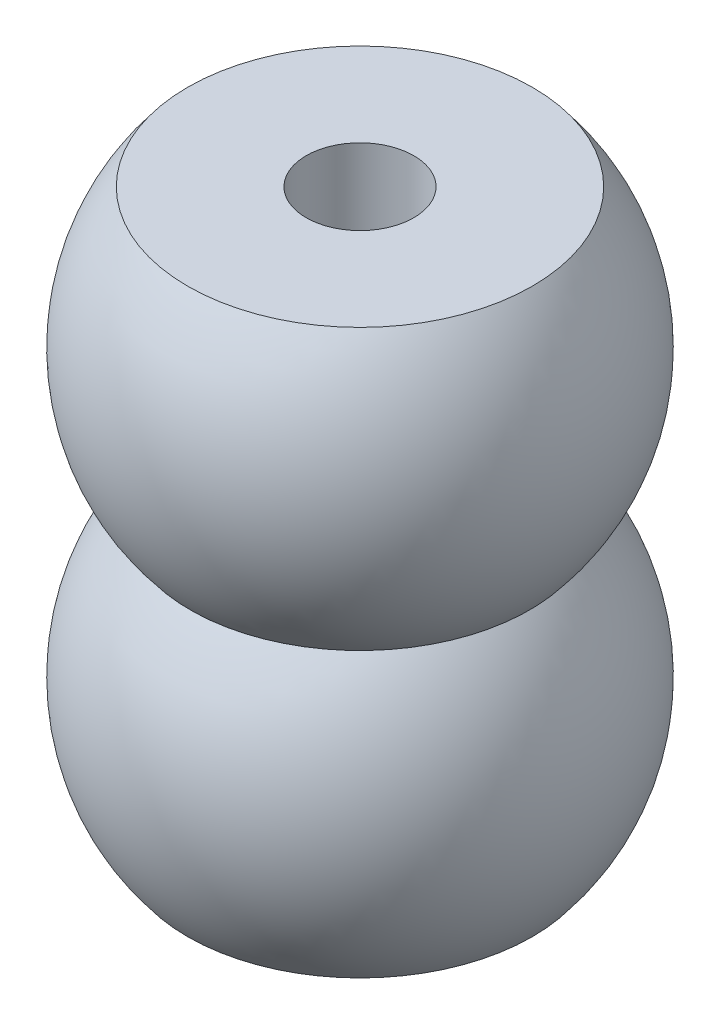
ISO-10303-21;
HEADER;
FILE_DESCRIPTION(('STEP AP214'),'2;1');
FILE_NAME('part.step','',(''),(''),'','','');
FILE_SCHEMA(('AUTOMOTIVE_DESIGN { 1 0 10303 214 1 1 1 1 }'));
ENDSEC;
DATA;
#1=APPLICATION_CONTEXT('core data for automotive mechanical design processes');
#2=APPLICATION_PROTOCOL_DEFINITION('international standard','automotive_design',2000,#1);
#3=PRODUCT_CONTEXT('',#1,'mechanical');
#4=PRODUCT('Part','Part','',(#3));
#5=PRODUCT_RELATED_PRODUCT_CATEGORY('part','',(#4));
#6=PRODUCT_DEFINITION_FORMATION('','',#4);
#7=PRODUCT_DEFINITION_CONTEXT('part definition',#1,'design');
#8=PRODUCT_DEFINITION('design','',#6,#7);
#9=PRODUCT_DEFINITION_SHAPE('','',#8);
#10=(LENGTH_UNIT() NAMED_UNIT(*) SI_UNIT(.MILLI.,.METRE.));
#11=(NAMED_UNIT(*) PLANE_ANGLE_UNIT() SI_UNIT($,.RADIAN.));
#12=(NAMED_UNIT(*) SI_UNIT($,.STERADIAN.) SOLID_ANGLE_UNIT());
#13=UNCERTAINTY_MEASURE_WITH_UNIT(LENGTH_MEASURE(1.E-05),#10,'distance_accuracy_value','');
#14=(GEOMETRIC_REPRESENTATION_CONTEXT(3) GLOBAL_UNCERTAINTY_ASSIGNED_CONTEXT((#13)) GLOBAL_UNIT_ASSIGNED_CONTEXT((#10,
#11,#12)) REPRESENTATION_CONTEXT('',''));
#15=CARTESIAN_POINT('',(0.,0.,0.));
#16=DIRECTION('',(0.,0.,1.));
#17=DIRECTION('',(1.,0.,0.));
#18=AXIS2_PLACEMENT_3D('',#15,#16,#17);
#19=CARTESIAN_POINT('',(0.,67.,0.));
#20=DIRECTION('',(0.,-1.,0.));
#21=DIRECTION('',(-1.,0.,0.));
#22=AXIS2_PLACEMENT_3D('',#19,#20,#21);
#23=SPHERICAL_SURFACE('',#22,35.);
#24=CARTESIAN_POINT('',(0.,44.5,0.));
#25=DIRECTION('',(0.,-1.,0.));
#26=DIRECTION('',(0.,0.,-1.));
#27=AXIS2_PLACEMENT_3D('',#24,#25,#26);
#28=CIRCLE('',#27,26.809513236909);
#29=CARTESIAN_POINT('',(-26.809513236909,44.5,0.));
#30=VERTEX_POINT('',#29);
#31=EDGE_CURVE('E10',#30,#30,#28,.T.);
#32=CARTESIAN_POINT('',(0.,89.,0.));
#33=DIRECTION('',(0.,-1.,0.));
#34=DIRECTION('',(0.,0.,-1.));
#35=AXIS2_PLACEMENT_3D('',#32,#33,#34);
#36=CIRCLE('',#35,27.2213151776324);
#37=CARTESIAN_POINT('',(-27.2213151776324,89.,0.));
#38=VERTEX_POINT('',#37);
#39=EDGE_CURVE('E48',#38,#38,#36,.T.);
#40=CARTESIAN_POINT('',(-26.809513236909,44.5,0.));
#41=CARTESIAN_POINT('',(-27.1324730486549,44.8848063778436,0.));
#42=CARTESIAN_POINT('',(-27.4471366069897,45.2765747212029,0.));
#43=CARTESIAN_POINT('',(-28.0593129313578,46.0732897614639,0.));
#44=CARTESIAN_POINT('',(-28.356825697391,46.4782364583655,0.));
#45=CARTESIAN_POINT('',(-28.9341421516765,47.3005626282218,0.));
#46=CARTESIAN_POINT('',(-29.2139458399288,47.7179421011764,0.));
#47=CARTESIAN_POINT('',(-29.755327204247,48.5643586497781,0.));
#48=CARTESIAN_POINT('',(-30.0169048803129,48.9933957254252,0.));
#49=CARTESIAN_POINT('',(-30.5213487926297,49.8623324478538,0.));
#50=CARTESIAN_POINT('',(-30.7642150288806,50.3022320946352,0.));
#51=CARTESIAN_POINT('',(-31.2307859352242,51.1920783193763,0.));
#52=CARTESIAN_POINT('',(-31.4544906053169,51.6420248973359,0.));
#53=CARTESIAN_POINT('',(-31.8823236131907,52.5511308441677,0.));
#54=CARTESIAN_POINT('',(-32.0864519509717,53.0102902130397,0.));
#55=CARTESIAN_POINT('',(-32.4747538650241,53.9369704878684,0.));
#56=CARTESIAN_POINT('',(-32.6589274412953,54.404491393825,0.));
#57=CARTESIAN_POINT('',(-33.0069783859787,55.3470279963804,0.));
#58=CARTESIAN_POINT('',(-33.1708557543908,55.8220436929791,0.));
#59=CARTESIAN_POINT('',(-33.4780104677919,56.7786892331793,0.));
#60=CARTESIAN_POINT('',(-33.621287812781,57.2603190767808,0.));
#61=CARTESIAN_POINT('',(-33.8869768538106,58.2293000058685,0.));
#62=CARTESIAN_POINT('',(-34.0093885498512,58.7166510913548,0.));
#63=CARTESIAN_POINT('',(-34.2331193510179,59.6961709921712,0.));
#64=CARTESIAN_POINT('',(-34.334438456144,60.1883398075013,0.));
#65=CARTESIAN_POINT('',(-34.5157962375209,61.1765827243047,0.));
#66=CARTESIAN_POINT('',(-34.5958349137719,61.672656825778,0.));
#67=CARTESIAN_POINT('',(-34.7344834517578,62.6677906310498,0.));
#68=CARTESIAN_POINT('',(-34.7930933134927,63.1668503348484,0.));
#69=CARTESIAN_POINT('',(-34.8887755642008,64.1670301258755,0.));
#70=CARTESIAN_POINT('',(-34.9258479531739,64.6681502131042,0.));
#71=CARTESIAN_POINT('',(-34.978386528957,65.6715217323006,0.));
#72=CARTESIAN_POINT('',(-34.9938527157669,66.1737731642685,0.));
#73=CARTESIAN_POINT('',(-35.0031502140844,67.1784762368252,0.));
#74=CARTESIAN_POINT('',(-34.996981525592,67.6809278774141,0.));
#75=CARTESIAN_POINT('',(-34.9630207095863,68.6850998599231,0.));
#76=CARTESIAN_POINT('',(-34.9352285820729,69.1868202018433,0.));
#77=CARTESIAN_POINT('',(-34.8580724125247,70.1885994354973,0.));
#78=CARTESIAN_POINT('',(-34.8087083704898,70.6886583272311,0.));
#79=CARTESIAN_POINT('',(-34.6884998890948,71.6861875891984,0.));
#80=CARTESIAN_POINT('',(-34.6176554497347,72.183657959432,0.));
#81=CARTESIAN_POINT('',(-34.4546175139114,73.1750879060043,0.));
#82=CARTESIAN_POINT('',(-34.362424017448,73.6690474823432,0.));
#83=CARTESIAN_POINT('',(-34.1568588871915,74.65254007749,0.));
#84=CARTESIAN_POINT('',(-34.0434872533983,75.142073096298,0.));
#85=CARTESIAN_POINT('',(-33.7957760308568,76.1158050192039,0.));
#86=CARTESIAN_POINT('',(-33.6614364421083,76.6000039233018,0.));
#87=CARTESIAN_POINT('',(-33.372038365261,77.5621699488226,0.));
#88=CARTESIAN_POINT('',(-33.2169798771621,78.0401370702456,0.));
#89=CARTESIAN_POINT('',(-32.8864314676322,78.9889534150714,0.));
#90=CARTESIAN_POINT('',(-32.7109415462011,79.4598026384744,0.));
#91=CARTESIAN_POINT('',(-32.3398556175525,80.393510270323,0.));
#92=CARTESIAN_POINT('',(-32.144259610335,80.8563686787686,0.));
#93=CARTESIAN_POINT('',(-31.7333241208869,81.7732365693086,0.));
#94=CARTESIAN_POINT('',(-31.5179846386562,82.2272460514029,0.));
#95=CARTESIAN_POINT('',(-31.0679614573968,83.125574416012,0.));
#96=CARTESIAN_POINT('',(-30.8332777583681,83.5698932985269,0.));
#97=CARTESIAN_POINT('',(-30.3450010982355,84.4480166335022,0.));
#98=CARTESIAN_POINT('',(-30.0914081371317,84.8818210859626,0.));
#99=CARTESIAN_POINT('',(-29.5657835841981,85.7381116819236,0.));
#100=CARTESIAN_POINT('',(-29.2937519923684,86.1605978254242,0.));
#101=CARTESIAN_POINT('',(-28.7317526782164,86.9934671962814,0.));
#102=CARTESIAN_POINT('',(-28.4417849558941,87.4038504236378,0.));
#103=CARTESIAN_POINT('',(-27.8444577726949,88.2117581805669,0.));
#104=CARTESIAN_POINT('',(-27.5370983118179,88.6092827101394,0.));
#105=CARTESIAN_POINT('',(-27.2213151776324,89.,0.));
#106=B_SPLINE_CURVE_WITH_KNOTS('',3,(#40,#41,#42,#43,#44,#45,#46,#47,#48,#49,#50,#51,#52,#53,
#54,#55,#56,#57,#58,#59,#60,#61,#62,#63,#64,#65,#66,#67,#68,#69,#70,#71,#72,#73,#74,#75,#76,#77,
#78,#79,#80,#81,#82,#83,#84,#85,#86,#87,#88,#89,#90,#91,#92,#93,#94,#95,#96,#97,#98,#99,#100,
#101,#102,#103,#104,#105),.UNSPECIFIED.,.F.,.F.,(4,2,2,2,2,2,2,2,2,2,2,2,2,2,2,2,2,2,2,2,2,2,2,
2,2,2,2,2,2,2,2,2,4),(0.,1.50700272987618,3.01400545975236,4.52100818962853,6.02801091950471,
7.5350136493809,9.04201637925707,10.5490191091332,12.0560218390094,13.5630245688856,
15.0700272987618,16.577030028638,18.0840327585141,19.5910354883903,21.0980382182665,
22.6050409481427,24.1120436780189,25.619046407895,27.1260491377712,28.6330518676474,
30.1400545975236,31.6470573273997,33.1540600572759,34.6610627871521,36.1680655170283,
37.6750682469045,39.1820709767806,40.6890737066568,42.196076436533,43.7030791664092,
45.2100818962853,46.7170846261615,48.2240873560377),.UNSPECIFIED.);
#107=EDGE_CURVE('BSEAM29',#30,#38,#106,.T.);
#108=ORIENTED_EDGE('',*,*,#31,.F.);
#109=ORIENTED_EDGE('',*,*,#39,.T.);
#110=ORIENTED_EDGE('',*,*,#107,.T.);
#111=ORIENTED_EDGE('',*,*,#107,.F.);
#112=EDGE_LOOP('',(#108,#110,#109,#111));
#113=FACE_BOUND('',#112,.T.);
#114=ADVANCED_FACE('F29',(#113),#23,.T.);
#115=CARTESIAN_POINT('',(0.,22.,0.));
#116=DIRECTION('',(0.,-1.,0.));
#117=DIRECTION('',(-1.,0.,0.));
#118=AXIS2_PLACEMENT_3D('',#115,#116,#117);
#119=SPHERICAL_SURFACE('',#118,35.);
#120=CARTESIAN_POINT('',(0.,0.,0.));
#121=DIRECTION('',(0.,-1.,0.));
#122=DIRECTION('',(0.,0.,-1.));
#123=AXIS2_PLACEMENT_3D('',#120,#121,#122);
#124=CIRCLE('',#123,27.2213151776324);
#125=CARTESIAN_POINT('',(-27.2213151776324,0.,0.));
#126=VERTEX_POINT('',#125);
#127=EDGE_CURVE('E35',#126,#126,#124,.T.);
#128=CARTESIAN_POINT('',(-27.2213151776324,0.,0.));
#129=CARTESIAN_POINT('',(-27.5370983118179,0.390717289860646,0.));
#130=CARTESIAN_POINT('',(-27.8444577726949,0.788241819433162,0.));
#131=CARTESIAN_POINT('',(-28.4417849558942,1.59614957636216,0.));
#132=CARTESIAN_POINT('',(-28.7317526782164,2.00653280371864,0.));
#133=CARTESIAN_POINT('',(-29.2937519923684,2.83940217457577,0.));
#134=CARTESIAN_POINT('',(-29.5657835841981,3.26188831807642,0.));
#135=CARTESIAN_POINT('',(-30.0914081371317,4.11817891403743,0.));
#136=CARTESIAN_POINT('',(-30.3450010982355,4.5519833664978,0.));
#137=CARTESIAN_POINT('',(-30.8332777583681,5.43010670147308,0.));
#138=CARTESIAN_POINT('',(-31.0679614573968,5.87442558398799,0.));
#139=CARTESIAN_POINT('',(-31.5179846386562,6.77275394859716,0.));
#140=CARTESIAN_POINT('',(-31.7333241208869,7.22676343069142,0.));
#141=CARTESIAN_POINT('',(-32.1442596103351,8.14363132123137,0.));
#142=CARTESIAN_POINT('',(-32.3398556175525,8.60648972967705,0.));
#143=CARTESIAN_POINT('',(-32.7109415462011,9.54019736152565,0.));
#144=CARTESIAN_POINT('',(-32.8864314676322,10.0110465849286,0.));
#145=CARTESIAN_POINT('',(-33.2169798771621,10.9598629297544,0.));
#146=CARTESIAN_POINT('',(-33.372038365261,11.4378300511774,0.));
#147=CARTESIAN_POINT('',(-33.6614364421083,12.3999960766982,0.));
#148=CARTESIAN_POINT('',(-33.7957760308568,12.8841949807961,0.));
#149=CARTESIAN_POINT('',(-34.0434872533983,13.857926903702,0.));
#150=CARTESIAN_POINT('',(-34.1568588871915,14.34745992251,0.));
#151=CARTESIAN_POINT('',(-34.362424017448,15.3309525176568,0.));
#152=CARTESIAN_POINT('',(-34.4546175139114,15.8249120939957,0.));
#153=CARTESIAN_POINT('',(-34.6176554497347,16.8163420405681,0.));
#154=CARTESIAN_POINT('',(-34.6884998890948,17.3138124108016,0.));
#155=CARTESIAN_POINT('',(-34.8087083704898,18.3113416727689,0.));
#156=CARTESIAN_POINT('',(-34.8580724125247,18.8114005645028,0.));
#157=CARTESIAN_POINT('',(-34.9352285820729,19.8131797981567,0.));
#158=CARTESIAN_POINT('',(-34.9630207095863,20.3149001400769,0.));
#159=CARTESIAN_POINT('',(-34.996981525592,21.319072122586,0.));
#160=CARTESIAN_POINT('',(-35.0031502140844,21.8215237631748,0.));
#161=CARTESIAN_POINT('',(-34.9938527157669,22.8262268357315,0.));
#162=CARTESIAN_POINT('',(-34.978386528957,23.3284782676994,0.));
#163=CARTESIAN_POINT('',(-34.9258479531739,24.3318497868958,0.));
#164=CARTESIAN_POINT('',(-34.8887755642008,24.8329698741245,0.));
#165=CARTESIAN_POINT('',(-34.7930933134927,25.8331496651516,0.));
#166=CARTESIAN_POINT('',(-34.7344834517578,26.3322093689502,0.));
#167=CARTESIAN_POINT('',(-34.5958349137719,27.327343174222,0.));
#168=CARTESIAN_POINT('',(-34.5157962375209,27.8234172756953,0.));
#169=CARTESIAN_POINT('',(-34.334438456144,28.8116601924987,0.));
#170=CARTESIAN_POINT('',(-34.2331193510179,29.3038290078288,0.));
#171=CARTESIAN_POINT('',(-34.0093885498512,30.2833489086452,0.));
#172=CARTESIAN_POINT('',(-33.8869768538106,30.7706999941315,0.));
#173=CARTESIAN_POINT('',(-33.621287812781,31.7396809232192,0.));
#174=CARTESIAN_POINT('',(-33.4780104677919,32.2213107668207,0.));
#175=CARTESIAN_POINT('',(-33.1708557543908,33.1779563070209,0.));
#176=CARTESIAN_POINT('',(-33.0069783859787,33.6529720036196,0.));
#177=CARTESIAN_POINT('',(-32.6589274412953,34.595508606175,0.));
#178=CARTESIAN_POINT('',(-32.4747538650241,35.0630295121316,0.));
#179=CARTESIAN_POINT('',(-32.0864519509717,35.9897097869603,0.));
#180=CARTESIAN_POINT('',(-31.8823236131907,36.4488691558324,0.));
#181=CARTESIAN_POINT('',(-31.4544906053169,37.3579751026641,0.));
#182=CARTESIAN_POINT('',(-31.2307859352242,37.8079216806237,0.));
#183=CARTESIAN_POINT('',(-30.7642150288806,38.6977679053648,0.));
#184=CARTESIAN_POINT('',(-30.5213487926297,39.1376675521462,0.));
#185=CARTESIAN_POINT('',(-30.0169048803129,40.0066042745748,0.));
#186=CARTESIAN_POINT('',(-29.755327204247,40.4356413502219,0.));
#187=CARTESIAN_POINT('',(-29.2139458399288,41.2820578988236,0.));
#188=CARTESIAN_POINT('',(-28.9341421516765,41.6994373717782,0.));
#189=CARTESIAN_POINT('',(-28.356825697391,42.5217635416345,0.));
#190=CARTESIAN_POINT('',(-28.0593129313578,42.9267102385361,0.));
#191=CARTESIAN_POINT('',(-27.4471366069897,43.7234252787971,0.));
#192=CARTESIAN_POINT('',(-27.1324730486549,44.1151936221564,0.));
#193=CARTESIAN_POINT('',(-26.809513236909,44.5,0.));
#194=B_SPLINE_CURVE_WITH_KNOTS('',3,(#128,#129,#130,#131,#132,#133,#134,#135,#136,#137,#138,
#139,#140,#141,#142,#143,#144,#145,#146,#147,#148,#149,#150,#151,#152,#153,#154,#155,#156,#157,
#158,#159,#160,#161,#162,#163,#164,#165,#166,#167,#168,#169,#170,#171,#172,#173,#174,#175,#176,
#177,#178,#179,#180,#181,#182,#183,#184,#185,#186,#187,#188,#189,#190,#191,#192,#193),
.UNSPECIFIED.,.F.,.F.,(4,2,2,2,2,2,2,2,2,2,2,2,2,2,2,2,2,2,2,2,2,2,2,2,2,2,2,2,2,2,2,2,4),(0.,
1.50700272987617,3.01400545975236,4.52100818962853,6.02801091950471,7.53501364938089,
9.04201637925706,10.5490191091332,12.0560218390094,13.5630245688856,15.0700272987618,
16.577030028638,18.0840327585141,19.5910354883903,21.0980382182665,22.6050409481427,
24.1120436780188,25.619046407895,27.1260491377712,28.6330518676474,30.1400545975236,
31.6470573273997,33.1540600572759,34.6610627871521,36.1680655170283,37.6750682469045,
39.1820709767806,40.6890737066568,42.196076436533,43.7030791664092,45.2100818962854,
46.7170846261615,48.2240873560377),.UNSPECIFIED.);
#195=EDGE_CURVE('BSEAM67',#126,#30,#194,.T.);
#196=ORIENTED_EDGE('',*,*,#127,.F.);
#197=ORIENTED_EDGE('',*,*,#31,.T.);
#198=ORIENTED_EDGE('',*,*,#195,.T.);
#199=ORIENTED_EDGE('',*,*,#195,.F.);
#200=EDGE_LOOP('',(#196,#198,#197,#199));
#201=FACE_BOUND('',#200,.T.);
#202=ADVANCED_FACE('F67',(#201),#119,.T.);
#203=CARTESIAN_POINT('',(-27.2213151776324,0.,0.));
#204=DIRECTION('',(0.,1.,0.));
#205=DIRECTION('',(0.,0.,1.));
#206=AXIS2_PLACEMENT_3D('',#203,#204,#205);
#207=PLANE('',#206);
#208=CARTESIAN_POINT('',(0.,0.,0.));
#209=DIRECTION('',(0.,-1.,0.));
#210=DIRECTION('',(0.,0.,-1.));
#211=AXIS2_PLACEMENT_3D('',#208,#209,#210);
#212=CIRCLE('',#211,8.5);
#213=CARTESIAN_POINT('',(0.,0.,-8.5));
#214=VERTEX_POINT('',#213);
#215=EDGE_CURVE('E39',#214,#214,#212,.T.);
#216=ORIENTED_EDGE('',*,*,#215,.F.);
#217=EDGE_LOOP('',(#216));
#218=FACE_BOUND('',#217,.T.);
#219=ORIENTED_EDGE('',*,*,#127,.T.);
#220=EDGE_LOOP('',(#219));
#221=FACE_BOUND('',#220,.T.);
#222=ADVANCED_FACE('F62',(#218,#221),#207,.F.);
#223=CARTESIAN_POINT('',(0.,-3.07763206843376,0.));
#224=DIRECTION('',(0.,-1.,0.));
#225=DIRECTION('',(0.,0.,-1.));
#226=AXIS2_PLACEMENT_3D('',#223,#224,#225);
#227=CYLINDRICAL_SURFACE('',#226,8.5);
#228=CARTESIAN_POINT('',(0.,89.,0.));
#229=DIRECTION('',(0.,-1.,0.));
#230=DIRECTION('',(0.,0.,-1.));
#231=AXIS2_PLACEMENT_3D('',#228,#229,#230);
#232=CIRCLE('',#231,8.50000000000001);
#233=CARTESIAN_POINT('',(0.,89.,-8.50000000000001));
#234=VERTEX_POINT('',#233);
#235=EDGE_CURVE('E43',#234,#234,#232,.T.);
#236=ORIENTED_EDGE('',*,*,#235,.F.);
#237=EDGE_LOOP('',(#236));
#238=FACE_BOUND('',#237,.T.);
#239=ORIENTED_EDGE('',*,*,#215,.T.);
#240=EDGE_LOOP('',(#239));
#241=FACE_BOUND('',#240,.T.);
#242=ADVANCED_FACE('F56',(#238,#241),#227,.F.);
#243=CARTESIAN_POINT('',(-27.2213151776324,89.,0.));
#244=DIRECTION('',(0.,-1.,0.));
#245=DIRECTION('',(0.,0.,-1.));
#246=AXIS2_PLACEMENT_3D('',#243,#244,#245);
#247=PLANE('',#246);
#248=ORIENTED_EDGE('',*,*,#39,.F.);
#249=EDGE_LOOP('',(#248));
#250=FACE_BOUND('',#249,.T.);
#251=ORIENTED_EDGE('',*,*,#235,.T.);
#252=EDGE_LOOP('',(#251));
#253=FACE_BOUND('',#252,.T.);
#254=ADVANCED_FACE('F53',(#250,#253),#247,.F.);
#255=CLOSED_SHELL('',(#114,#202,#222,#242,#254));
#256=MANIFOLD_SOLID_BREP('B2',#255);
#257=ADVANCED_BREP_SHAPE_REPRESENTATION('',(#18,#256),#14);
#258=SHAPE_DEFINITION_REPRESENTATION(#9,#257);
ENDSEC;
END-ISO-10303-21;
